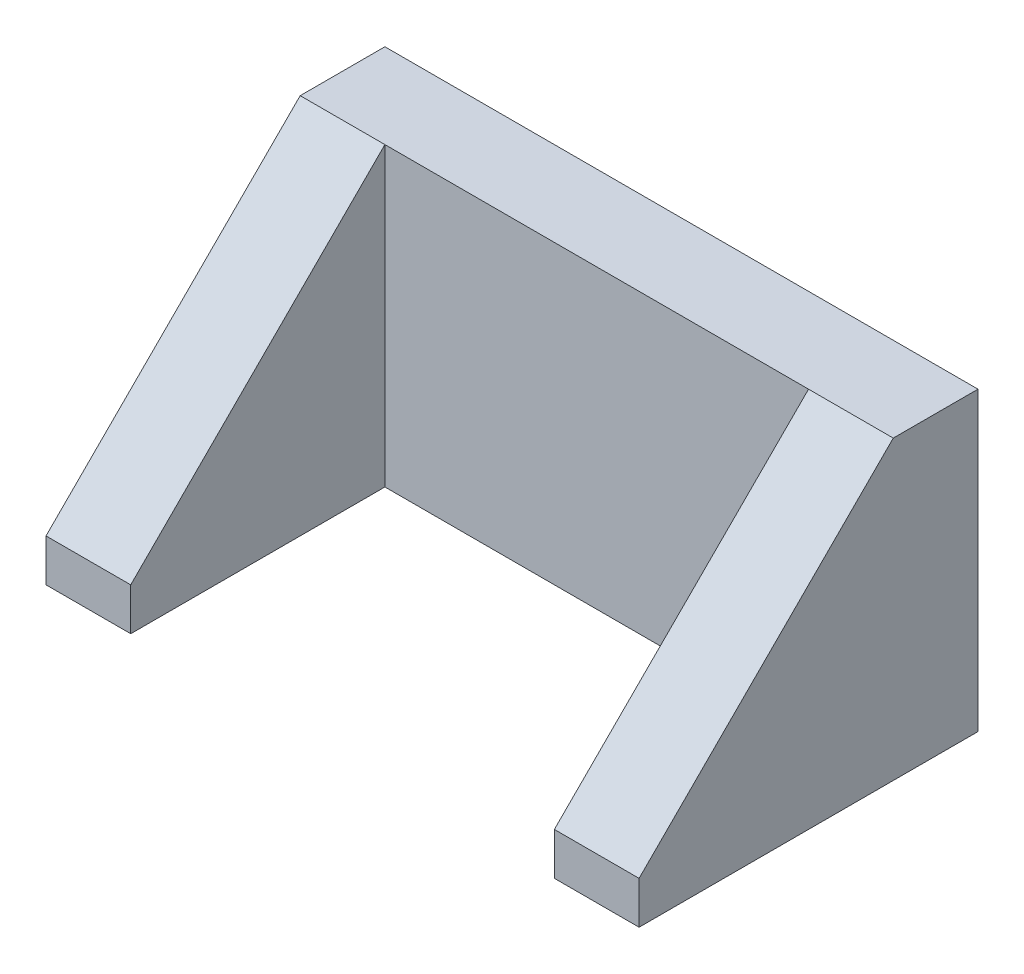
from build123d import *

# Parameters (mm, degrees)
BOSS_EXTRUDE1_DEPTH = 12.7
SKETCH2_W           = 177.8
SKETCH2_H           = 25.4
BOSS_EXTRUDE2_DEPTH = 76.2
BOSS_EXTRUDE3_DEPTH = 25.4
SKETCH5_W           = 177.8
SKETCH5_H           = 76.2
CUT_EXTRUDE1_DEPTH  = 76.2


with BuildPart() as part:
    # Sketch1 → Boss-Extrude1 (new body)
    with BuildSketch(Plane(origin=(0, 0, 0), x_dir=(1, 0, 0), z_dir=(0, 1, 0))):
        Polygon((0, 0), (25.4, 0), (25.4, 152.4), (152.4, 152.4), (152.4, 0), (177.8, 0), (177.8, 177.8), (0, 177.8), align=None)
    extrude(amount=BOSS_EXTRUDE1_DEPTH)

    # Sketch2 → Boss-Extrude2 (add)
    with BuildSketch(Plane(origin=(0, 12.7, 0), x_dir=(1, 0, 0), z_dir=(0, 1, 0))):
        with Locations((88.9, 165.1)):
            Rectangle(SKETCH2_W, SKETCH2_H)
    extrude(amount=BOSS_EXTRUDE2_DEPTH)

    # Sketch4 → Boss-Extrude3 (add)
    with BuildSketch(Plane(origin=(177.8, 0, 0), x_dir=(0, 0, -1), z_dir=(1, 0, 0))):
        Polygon((152.4, 88.9), (152.4, 12.7), (76.2, 12.7), align=None)
    boss_extrude3 = extrude(amount=-BOSS_EXTRUDE3_DEPTH)

    # Mirror1: Boss-Extrude3 across plane
    add(boss_extrude3.mirror(Plane(origin=(88.9, 0, 0), x_dir=(0, 0, 1), z_dir=(1, 0, 0))))

    # Sketch5 → Cut-Extrude1 (cut)
    with BuildSketch(Plane(origin=(0, 12.7, 0), x_dir=(1, 0, 0), z_dir=(0, 1, 0))):
        with Locations((88.9, 38.1)):
            Rectangle(SKETCH5_W, SKETCH5_H)
    extrude(amount=-CUT_EXTRUDE1_DEPTH, mode=Mode.SUBTRACT)


solid = part.part
